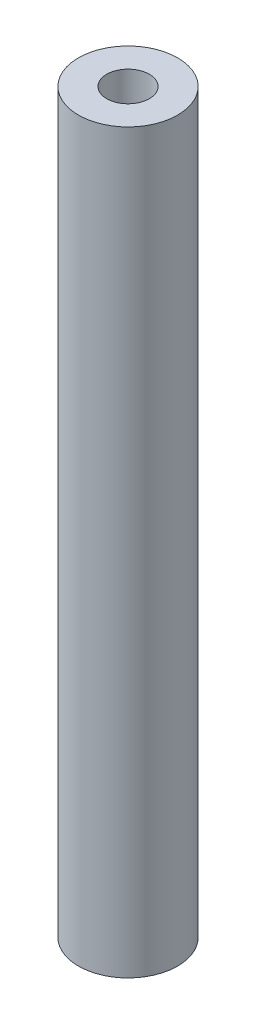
from build123d import *

# Parameters (mm, degrees)
SKETCH1_R           = 3.5
SKETCH1_R_2         = 1.5
BOSS_EXTRUDE1_DEPTH = 52


with BuildPart() as part:
    # Sketch1 → Boss-Extrude1 (new body)
    with BuildSketch(Plane(origin=(0, 0, 0), x_dir=(1, 0, 0), z_dir=(0, 1, 0))):
        with Locations(Location((0, 0, 0), (0, 0, 90))):
            Circle(SKETCH1_R)
        with Locations(Location((0, 0, 0), (0, 0, 90))):
            Circle(SKETCH1_R_2, mode=Mode.SUBTRACT)
    extrude(amount=BOSS_EXTRUDE1_DEPTH)


solid = part.part
